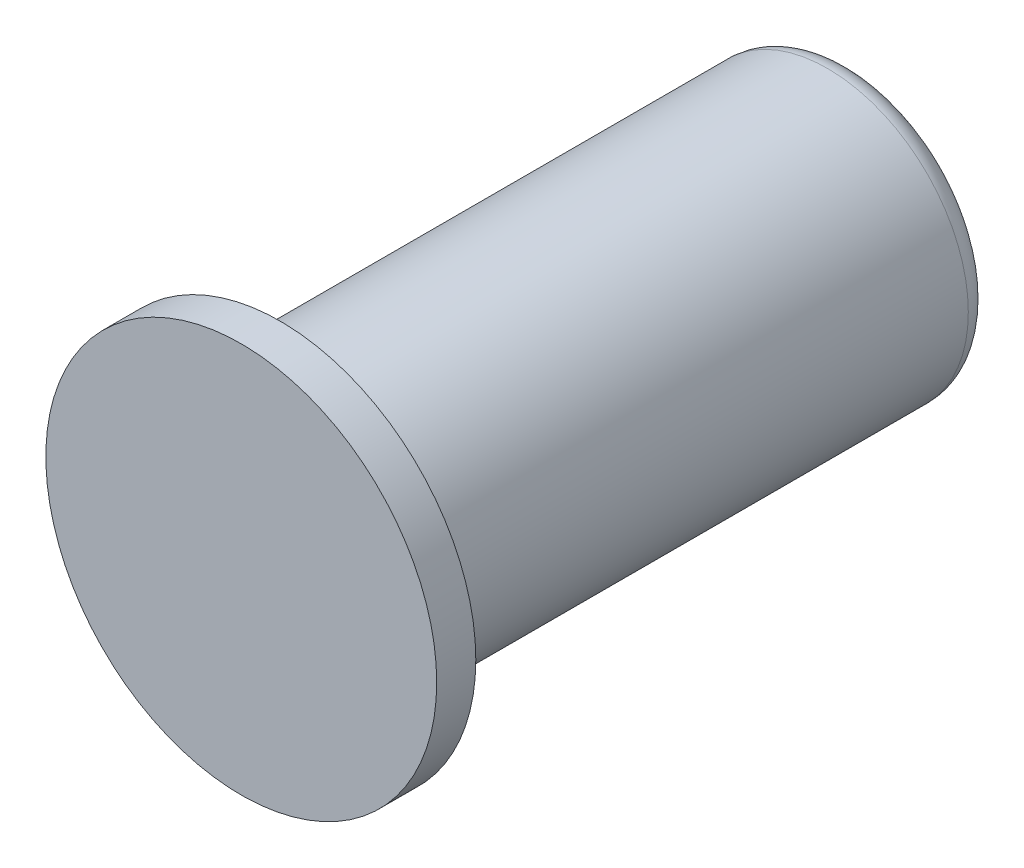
ISO-10303-21;
HEADER;
FILE_DESCRIPTION(('STEP AP214'),'2;1');
FILE_NAME('part.step','',(''),(''),'','','');
FILE_SCHEMA(('AUTOMOTIVE_DESIGN { 1 0 10303 214 1 1 1 1 }'));
ENDSEC;
DATA;
#1=APPLICATION_CONTEXT('core data for automotive mechanical design processes');
#2=APPLICATION_PROTOCOL_DEFINITION('international standard','automotive_design',2000,#1);
#3=PRODUCT_CONTEXT('',#1,'mechanical');
#4=PRODUCT('Part','Part','',(#3));
#5=PRODUCT_RELATED_PRODUCT_CATEGORY('part','',(#4));
#6=PRODUCT_DEFINITION_FORMATION('','',#4);
#7=PRODUCT_DEFINITION_CONTEXT('part definition',#1,'design');
#8=PRODUCT_DEFINITION('design','',#6,#7);
#9=PRODUCT_DEFINITION_SHAPE('','',#8);
#10=(LENGTH_UNIT() NAMED_UNIT(*) SI_UNIT(.MILLI.,.METRE.));
#11=(NAMED_UNIT(*) PLANE_ANGLE_UNIT() SI_UNIT($,.RADIAN.));
#12=(NAMED_UNIT(*) SI_UNIT($,.STERADIAN.) SOLID_ANGLE_UNIT());
#13=UNCERTAINTY_MEASURE_WITH_UNIT(LENGTH_MEASURE(1.E-05),#10,'distance_accuracy_value','');
#14=(GEOMETRIC_REPRESENTATION_CONTEXT(3) GLOBAL_UNCERTAINTY_ASSIGNED_CONTEXT((#13)) GLOBAL_UNIT_ASSIGNED_CONTEXT((#10,
#11,#12)) REPRESENTATION_CONTEXT('',''));
#15=CARTESIAN_POINT('',(0.,0.,0.));
#16=DIRECTION('',(0.,0.,1.));
#17=DIRECTION('',(1.,0.,0.));
#18=AXIS2_PLACEMENT_3D('',#15,#16,#17);
#19=CARTESIAN_POINT('',(0.,0.,0.));
#20=DIRECTION('',(0.,0.,-1.));
#21=DIRECTION('',(-1.,0.,0.));
#22=AXIS2_PLACEMENT_3D('',#19,#20,#21);
#23=PLANE('',#22);
#24=CARTESIAN_POINT('',(0.,0.,0.));
#25=DIRECTION('',(0.,0.,1.));
#26=DIRECTION('',(1.,0.,0.));
#27=AXIS2_PLACEMENT_3D('',#24,#25,#26);
#28=CIRCLE('',#27,25.);
#29=CARTESIAN_POINT('',(25.,0.,0.));
#30=VERTEX_POINT('',#29);
#31=EDGE_CURVE('E11',#30,#30,#28,.T.);
#32=ORIENTED_EDGE('',*,*,#31,.T.);
#33=EDGE_LOOP('',(#32));
#34=FACE_BOUND('',#33,.T.);
#35=ADVANCED_FACE('F32',(#34),#23,.F.);
#36=CARTESIAN_POINT('',(0.,0.,0.));
#37=DIRECTION('',(0.,0.,1.));
#38=DIRECTION('',(1.,0.,0.));
#39=AXIS2_PLACEMENT_3D('',#36,#37,#38);
#40=CYLINDRICAL_SURFACE('',#39,25.);
#41=ORIENTED_EDGE('',*,*,#31,.F.);
#42=EDGE_LOOP('',(#41));
#43=FACE_BOUND('',#42,.T.);
#44=CARTESIAN_POINT('',(0.,0.,-5.));
#45=DIRECTION('',(0.,0.,1.));
#46=DIRECTION('',(1.,0.,0.));
#47=AXIS2_PLACEMENT_3D('',#44,#45,#46);
#48=CIRCLE('',#47,25.);
#49=CARTESIAN_POINT('',(25.,0.,-5.));
#50=VERTEX_POINT('',#49);
#51=EDGE_CURVE('E38',#50,#50,#48,.T.);
#52=ORIENTED_EDGE('',*,*,#51,.T.);
#53=EDGE_LOOP('',(#52));
#54=FACE_BOUND('',#53,.T.);
#55=ADVANCED_FACE('F54',(#43,#54),#40,.T.);
#56=CARTESIAN_POINT('',(0.,25.,-5.));
#57=DIRECTION('',(0.,0.,1.));
#58=DIRECTION('',(1.,0.,0.));
#59=AXIS2_PLACEMENT_3D('',#56,#57,#58);
#60=PLANE('',#59);
#61=ORIENTED_EDGE('',*,*,#51,.F.);
#62=EDGE_LOOP('',(#61));
#63=FACE_BOUND('',#62,.T.);
#64=CARTESIAN_POINT('',(0.,0.,-5.));
#65=DIRECTION('',(0.,0.,1.));
#66=DIRECTION('',(1.,0.,0.));
#67=AXIS2_PLACEMENT_3D('',#64,#65,#66);
#68=CIRCLE('',#67,18.);
#69=CARTESIAN_POINT('',(18.,0.,-5.));
#70=VERTEX_POINT('',#69);
#71=EDGE_CURVE('E66',#70,#70,#68,.T.);
#72=ORIENTED_EDGE('',*,*,#71,.T.);
#73=EDGE_LOOP('',(#72));
#74=FACE_BOUND('',#73,.T.);
#75=ADVANCED_FACE('F59',(#63,#74),#60,.F.);
#76=CARTESIAN_POINT('',(0.,0.,0.));
#77=DIRECTION('',(0.,0.,1.));
#78=DIRECTION('',(1.,0.,0.));
#79=AXIS2_PLACEMENT_3D('',#76,#77,#78);
#80=CYLINDRICAL_SURFACE('',#79,18.);
#81=ORIENTED_EDGE('',*,*,#71,.F.);
#82=EDGE_LOOP('',(#81));
#83=FACE_BOUND('',#82,.T.);
#84=CARTESIAN_POINT('',(0.,0.,-75.));
#85=DIRECTION('',(0.,0.,1.));
#86=DIRECTION('',(1.,0.,0.));
#87=AXIS2_PLACEMENT_3D('',#84,#85,#86);
#88=CIRCLE('',#87,18.);
#89=CARTESIAN_POINT('',(18.,0.,-75.));
#90=VERTEX_POINT('',#89);
#91=EDGE_CURVE('E68',#90,#90,#88,.T.);
#92=ORIENTED_EDGE('',*,*,#91,.T.);
#93=EDGE_LOOP('',(#92));
#94=FACE_BOUND('',#93,.T.);
#95=ADVANCED_FACE('F101',(#83,#94),#80,.T.);
#96=CARTESIAN_POINT('',(0.,0.,-75.));
#97=DIRECTION('',(0.,0.,1.));
#98=DIRECTION('',(1.,0.,0.));
#99=AXIS2_PLACEMENT_3D('',#96,#97,#98);
#100=TOROIDAL_SURFACE('',#99,15.,3.);
#101=ORIENTED_EDGE('',*,*,#91,.F.);
#102=EDGE_LOOP('',(#101));
#103=FACE_BOUND('',#102,.T.);
#104=CARTESIAN_POINT('',(0.,0.,-78.));
#105=DIRECTION('',(0.,0.,1.));
#106=DIRECTION('',(1.,0.,0.));
#107=AXIS2_PLACEMENT_3D('',#104,#105,#106);
#108=CIRCLE('',#107,15.);
#109=CARTESIAN_POINT('',(15.,0.,-78.));
#110=VERTEX_POINT('',#109);
#111=EDGE_CURVE('E73',#110,#110,#108,.T.);
#112=ORIENTED_EDGE('',*,*,#111,.T.);
#113=EDGE_LOOP('',(#112));
#114=FACE_BOUND('',#113,.T.);
#115=ADVANCED_FACE('F94',(#103,#114),#100,.T.);
#116=CARTESIAN_POINT('',(0.,4.49999999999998,-78.));
#117=DIRECTION('',(0.,0.,1.));
#118=DIRECTION('',(1.,0.,0.));
#119=AXIS2_PLACEMENT_3D('',#116,#117,#118);
#120=PLANE('',#119);
#121=ORIENTED_EDGE('',*,*,#111,.F.);
#122=EDGE_LOOP('',(#121));
#123=FACE_BOUND('',#122,.T.);
#124=CARTESIAN_POINT('',(0.,0.,-78.));
#125=DIRECTION('',(0.,0.,1.));
#126=DIRECTION('',(1.,0.,0.));
#127=AXIS2_PLACEMENT_3D('',#124,#125,#126);
#128=CIRCLE('',#127,4.49999999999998);
#129=CARTESIAN_POINT('',(4.49999999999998,0.,-78.));
#130=VERTEX_POINT('',#129);
#131=EDGE_CURVE('E76',#130,#130,#128,.T.);
#132=ORIENTED_EDGE('',*,*,#131,.T.);
#133=EDGE_LOOP('',(#132));
#134=FACE_BOUND('',#133,.T.);
#135=ADVANCED_FACE('F88',(#123,#134),#120,.F.);
#136=CARTESIAN_POINT('',(0.,0.,-77.5));
#137=DIRECTION('',(0.,0.,-1.));
#138=DIRECTION('',(-1.,0.,0.));
#139=AXIS2_PLACEMENT_3D('',#136,#137,#138);
#140=CONICAL_SURFACE('',#139,3.99999999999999,0.785398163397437);
#141=ORIENTED_EDGE('',*,*,#131,.F.);
#142=EDGE_LOOP('',(#141));
#143=FACE_BOUND('',#142,.T.);
#144=CARTESIAN_POINT('',(0.,0.,-77.5));
#145=DIRECTION('',(0.,0.,1.));
#146=DIRECTION('',(1.,0.,0.));
#147=AXIS2_PLACEMENT_3D('',#144,#145,#146);
#148=CIRCLE('',#147,3.99999999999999);
#149=CARTESIAN_POINT('',(3.99999999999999,0.,-77.5));
#150=VERTEX_POINT('',#149);
#151=EDGE_CURVE('E79',#150,#150,#148,.T.);
#152=ORIENTED_EDGE('',*,*,#151,.T.);
#153=EDGE_LOOP('',(#152));
#154=FACE_BOUND('',#153,.T.);
#155=ADVANCED_FACE('F49',(#143,#154),#140,.F.);
#156=CARTESIAN_POINT('',(0.,0.,0.));
#157=DIRECTION('',(0.,0.,1.));
#158=DIRECTION('',(1.,0.,0.));
#159=AXIS2_PLACEMENT_3D('',#156,#157,#158);
#160=CYLINDRICAL_SURFACE('',#159,3.99999999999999);
#161=ORIENTED_EDGE('',*,*,#151,.F.);
#162=EDGE_LOOP('',(#161));
#163=FACE_BOUND('',#162,.T.);
#164=CARTESIAN_POINT('',(0.,0.,-69.));
#165=DIRECTION('',(0.,0.,1.));
#166=DIRECTION('',(1.,0.,0.));
#167=AXIS2_PLACEMENT_3D('',#164,#165,#166);
#168=CIRCLE('',#167,3.99999999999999);
#169=CARTESIAN_POINT('',(3.99999999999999,0.,-69.));
#170=VERTEX_POINT('',#169);
#171=EDGE_CURVE('E82',#170,#170,#168,.T.);
#172=ORIENTED_EDGE('',*,*,#171,.T.);
#173=EDGE_LOOP('',(#172));
#174=FACE_BOUND('',#173,.T.);
#175=ADVANCED_FACE('F43',(#163,#174),#160,.F.);
#176=CARTESIAN_POINT('',(0.,0.,-66.6905989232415));
#177=DIRECTION('',(0.,0.,-1.));
#178=DIRECTION('',(-1.,0.,0.));
#179=AXIS2_PLACEMENT_3D('',#176,#177,#178);
#180=CONICAL_SURFACE('',#179,0.,1.0471975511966);
#181=ORIENTED_EDGE('',*,*,#171,.F.);
#182=EDGE_LOOP('',(#181));
#183=FACE_BOUND('',#182,.T.);
#184=CARTESIAN_POINT('',(0.,0.,-66.6905989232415));
#185=VERTEX_POINT('',#184);
#186=VERTEX_LOOP('',#185);
#187=FACE_BOUND('',#186,.T.);
#188=ADVANCED_FACE('F41',(#183,#187),#180,.F.);
#189=CLOSED_SHELL('',(#35,#55,#75,#95,#115,#135,#155,#175,#188));
#190=MANIFOLD_SOLID_BREP('B2',#189);
#191=ADVANCED_BREP_SHAPE_REPRESENTATION('',(#18,#190),#14);
#192=SHAPE_DEFINITION_REPRESENTATION(#9,#191);
ENDSEC;
END-ISO-10303-21;
